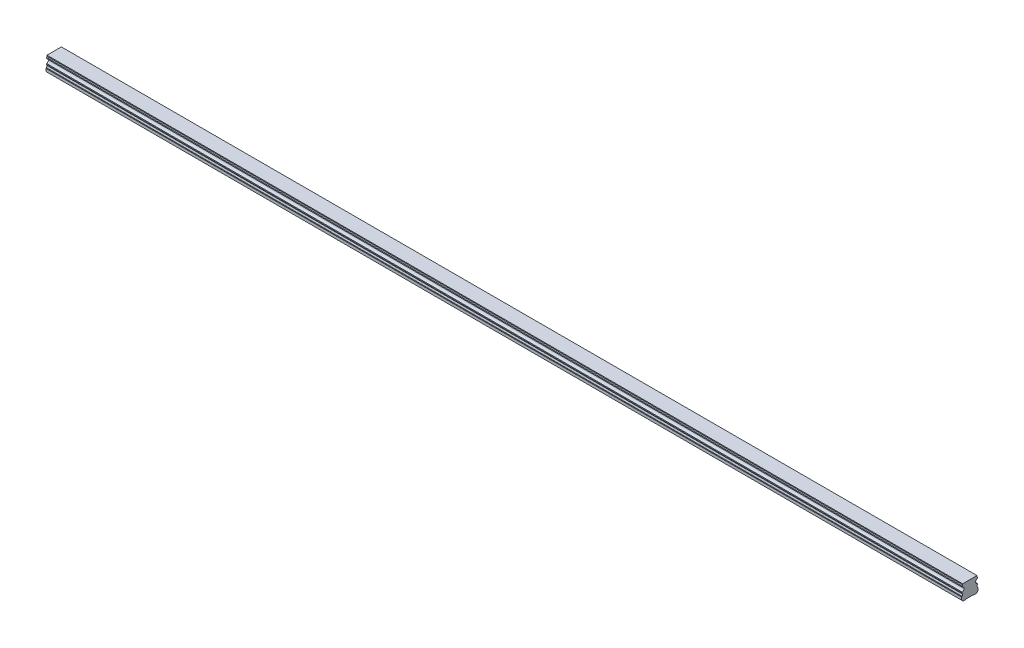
from build123d import *

# Parameters (mm, degrees)
BOSS_EXTRUDE1_DEPTH        = 840
SKETCH3_R                  = 2.5
SKETCH3_R_2                = 2.1
CUT_EXTRUDE3_DEPTH         = 7
SKETCH3_2_R                = 2.1
CUT_EXTRUDE4_DEPTH         = 9.5
CHAMFER1_SIZE              = 0.4
LPATTERN2_COUNT            = 14
LPATTERN2_PITCH            = 60
CHAMFER1_OF_LPATTERN2_SIZE = 0.4


with BuildPart() as part:
    # Sketch1 → Boss-Extrude1 (new body)
    with BuildSketch(Plane(origin=(0, 0, 0), x_dir=(0, 0, -1), z_dir=(1, 0, 0))):
        with BuildLine():
            Line((6.59, 14), (-6.59, 14))
            Line((-6.59, 14), (-6.59, 13.15))
            Line((-6.59, 13.15), (-6.96, 12.356532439))
            Line((-6.96, 12.356532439), (-6.96, 11.435174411))
            ThreePointArc((-6.96, 11.435174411), (-5.25, 9.5), (-6.96, 7.564825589))
            Line((-6.96, 7.564825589), (-6.96, 6.643467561))
            Line((-6.96, 6.643467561), (-6.59, 5.85))
            Line((-6.59, 5.85), (-7.032116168, 4.2))
            Line((-7.032116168, 4.2), (-7.5, 3.929867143))
            Line((-7.5, 3.929867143), (-7.5, 1.4))
            Line((-7.5, 1.4), (-6.1, 0))
            Line((-6.1, 0), (-3.65, 0))
            Line((-3.65, 0), (-3.25, 0.4))
            Line((-3.25, 0.4), (3.25, 0.4))
            Line((3.25, 0.4), (3.65, 0))
            Line((3.65, 0), (6.1, 0))
            Line((6.1, 0), (7.5, 1.4))
            Line((7.5, 1.4), (7.5, 3.929867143))
            Line((7.5, 3.929867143), (7.032116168, 4.2))
            Line((7.032116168, 4.2), (6.59, 5.85))
            Line((6.59, 5.85), (6.96, 6.643467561))
            Line((6.96, 6.643467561), (6.96, 7.564825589))
            ThreePointArc((6.96, 7.564825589), (5.25, 9.5), (6.96, 11.435174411))
            Line((6.96, 11.435174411), (6.96, 12.356532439))
            Line((6.96, 12.356532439), (6.59, 13.15))
            Line((6.59, 13.15), (6.59, 14))
        make_face()
    extrude(amount=BOSS_EXTRUDE1_DEPTH)

    # Sketch3 → Cut-Extrude3 (cut)
    with BuildSketch(Plane.XZ):
        with Locations(Location((30, 0, 0), (0, 0, 270))):
            Circle(SKETCH3_R)
        with Locations(Location((30, 0, 0), (0, 0, 270))):
            Circle(SKETCH3_R_2, mode=Mode.SUBTRACT)
    cut_extrude3 = extrude(amount=-CUT_EXTRUDE3_DEPTH, mode=Mode.SUBTRACT)

    # Sketch3_2 → Cut-Extrude4 (cut)
    with BuildSketch(Plane.XZ):
        with Locations(Location((30, 0, 0), (0, 0, 270))):
            Circle(SKETCH3_2_R)
    cut_extrude4 = extrude(amount=-CUT_EXTRUDE4_DEPTH, mode=Mode.SUBTRACT)

    # Cut-Extrude5 cone 1 section (on through the dimple's axis) → Cut-Extrude5 (revolve, cut)
    with BuildSketch(Plane(origin=(30, 9.5, 0), x_dir=(0, 0, -1), z_dir=(1, 0, 0))):
        Polygon((0, 0), (2.1, 0), (0, 1.212435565), align=None)
    revolve(axis=Axis((30, 9.5, 0), (0, 1, 0)), mode=Mode.SUBTRACT)

    # Chamfer1
    chamfer1_edges = [part.edges().sort_by_distance(p)[0] for p in [
        (30, 0.4, 2.5),
    ]]
    chamfer(chamfer1_edges, length=CHAMFER1_SIZE)

    # LPattern2: Cut-Extrude3, Cut-Extrude4 ×14
    with Locations(*[(i * LPATTERN2_PITCH, 0, 0) for i in range(1, LPATTERN2_COUNT)]):
        add(cut_extrude3, mode=Mode.SUBTRACT)
        add(cut_extrude4, mode=Mode.SUBTRACT)

    # Chamfer1 of LPattern2
    chamfer1_of_lpattern2_edges = [part.edges().sort_by_distance(p)[0] for p in [
        (90, 0.4, 2.5),
        (150, 0.4, 2.5),
        (210, 0.4, 2.5),
        (270, 0.4, 2.5),
        (330, 0.4, 2.5),
        (390, 0.4, 2.5),
        (450, 0.4, 2.5),
        (510, 0.4, 2.5),
        (570, 0.4, 2.5),
        (630, 0.4, 2.5),
        (690, 0.4, 2.5),
        (750, 0.4, 2.5),
        (810, 0.4, 2.5),
    ]]
    chamfer(chamfer1_of_lpattern2_edges, length=CHAMFER1_OF_LPATTERN2_SIZE)


solid = part.part
